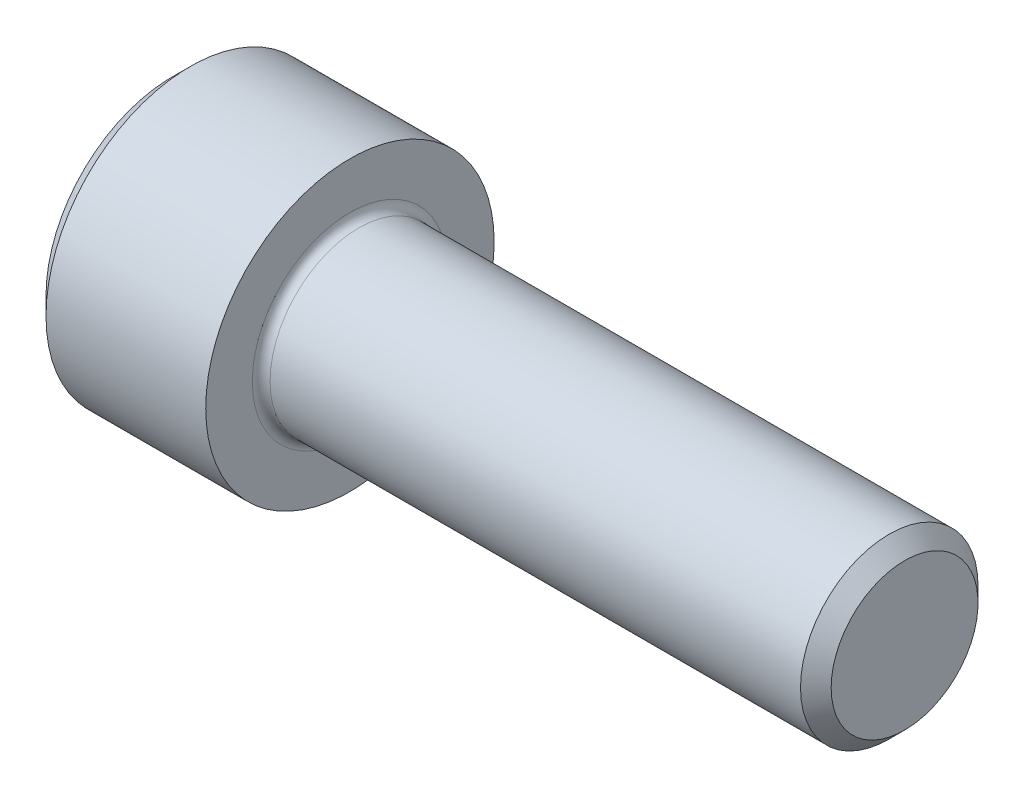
ISO-10303-21;
HEADER;
FILE_DESCRIPTION(('STEP AP214'),'2;1');
FILE_NAME('part.step','',(''),(''),'','','');
FILE_SCHEMA(('AUTOMOTIVE_DESIGN { 1 0 10303 214 1 1 1 1 }'));
ENDSEC;
DATA;
#1=APPLICATION_CONTEXT('core data for automotive mechanical design processes');
#2=APPLICATION_PROTOCOL_DEFINITION('international standard','automotive_design',2000,#1);
#3=PRODUCT_CONTEXT('',#1,'mechanical');
#4=PRODUCT('Part','Part','',(#3));
#5=PRODUCT_RELATED_PRODUCT_CATEGORY('part','',(#4));
#6=PRODUCT_DEFINITION_FORMATION('','',#4);
#7=PRODUCT_DEFINITION_CONTEXT('part definition',#1,'design');
#8=PRODUCT_DEFINITION('design','',#6,#7);
#9=PRODUCT_DEFINITION_SHAPE('','',#8);
#10=(LENGTH_UNIT() NAMED_UNIT(*) SI_UNIT(.MILLI.,.METRE.));
#11=(NAMED_UNIT(*) PLANE_ANGLE_UNIT() SI_UNIT($,.RADIAN.));
#12=(NAMED_UNIT(*) SI_UNIT($,.STERADIAN.) SOLID_ANGLE_UNIT());
#13=UNCERTAINTY_MEASURE_WITH_UNIT(LENGTH_MEASURE(1.E-05),#10,'distance_accuracy_value','');
#14=(GEOMETRIC_REPRESENTATION_CONTEXT(3) GLOBAL_UNCERTAINTY_ASSIGNED_CONTEXT((#13)) GLOBAL_UNIT_ASSIGNED_CONTEXT((#10,
#11,#12)) REPRESENTATION_CONTEXT('',''));
#15=CARTESIAN_POINT('',(0.,0.,0.));
#16=DIRECTION('',(0.,0.,1.));
#17=DIRECTION('',(1.,0.,0.));
#18=AXIS2_PLACEMENT_3D('',#15,#16,#17);
#19=CARTESIAN_POINT('',(33.,-3.349214,3.349214));
#20=DIRECTION('',(1.,0.,0.));
#21=DIRECTION('',(0.,0.,-1.));
#22=AXIS2_PLACEMENT_3D('',#19,#20,#21);
#23=PLANE('',#22);
#24=CARTESIAN_POINT('',(33.,0.,0.));
#25=DIRECTION('',(-1.,0.,0.));
#26=DIRECTION('',(0.,0.,1.));
#27=AXIS2_PLACEMENT_3D('',#24,#25,#26);
#28=CIRCLE('',#27,3.30949999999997);
#29=CARTESIAN_POINT('',(33.,0.,3.30949999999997));
#30=VERTEX_POINT('',#29);
#31=EDGE_CURVE('E20',#30,#30,#28,.F.);
#32=ORIENTED_EDGE('',*,*,#31,.T.);
#33=EDGE_LOOP('',(#32));
#34=FACE_BOUND('',#33,.T.);
#35=ADVANCED_FACE('F16',(#34),#23,.T.);
#36=CARTESIAN_POINT('',(33.,0.,0.));
#37=DIRECTION('',(-1.,0.,0.));
#38=DIRECTION('',(0.,0.,1.));
#39=AXIS2_PLACEMENT_3D('',#36,#37,#38);
#40=CONICAL_SURFACE('',#39,3.3095,0.785398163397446);
#41=CARTESIAN_POINT('',(32.3095,0.,0.));
#42=DIRECTION('',(-1.,0.,0.));
#43=DIRECTION('',(0.,0.,1.));
#44=AXIS2_PLACEMENT_3D('',#41,#42,#43);
#45=CIRCLE('',#44,4.);
#46=CARTESIAN_POINT('',(32.3095,0.,4.));
#47=VERTEX_POINT('',#46);
#48=EDGE_CURVE('E124',#47,#47,#45,.F.);
#49=ORIENTED_EDGE('',*,*,#48,.T.);
#50=EDGE_LOOP('',(#49));
#51=FACE_BOUND('',#50,.T.);
#52=ORIENTED_EDGE('',*,*,#31,.F.);
#53=EDGE_LOOP('',(#52));
#54=FACE_BOUND('',#53,.T.);
#55=ADVANCED_FACE('F254',(#51,#54),#40,.T.);
#56=CARTESIAN_POINT('',(32.3095,0.,0.));
#57=DIRECTION('',(-1.,0.,0.));
#58=DIRECTION('',(0.,0.,1.));
#59=AXIS2_PLACEMENT_3D('',#56,#57,#58);
#60=CYLINDRICAL_SURFACE('',#59,4.);
#61=CARTESIAN_POINT('',(8.40000000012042,0.,0.));
#62=DIRECTION('',(1.,0.,0.));
#63=DIRECTION('',(0.,0.,-1.));
#64=AXIS2_PLACEMENT_3D('',#61,#62,#63);
#65=CIRCLE('',#64,4.00000000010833);
#66=CARTESIAN_POINT('',(8.40000000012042,0.,-4.00000000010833));
#67=VERTEX_POINT('',#66);
#68=EDGE_CURVE('E120',#67,#67,#65,.T.);
#69=ORIENTED_EDGE('',*,*,#68,.T.);
#70=EDGE_LOOP('',(#69));
#71=FACE_BOUND('',#70,.T.);
#72=ORIENTED_EDGE('',*,*,#48,.F.);
#73=EDGE_LOOP('',(#72));
#74=FACE_BOUND('',#73,.T.);
#75=ADVANCED_FACE('F250',(#71,#74),#60,.T.);
#76=CARTESIAN_POINT('',(8.40000000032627,0.,0.));
#77=DIRECTION('',(1.,0.,0.));
#78=DIRECTION('',(0.,0.,-1.));
#79=AXIS2_PLACEMENT_3D('',#76,#77,#78);
#80=TOROIDAL_SURFACE('',#79,4.40000000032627,0.400000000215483);
#81=ORIENTED_EDGE('',*,*,#68,.F.);
#82=EDGE_LOOP('',(#81));
#83=FACE_BOUND('',#82,.T.);
#84=CARTESIAN_POINT('',(8.00000000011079,0.,0.));
#85=DIRECTION('',(1.,0.,0.));
#86=DIRECTION('',(0.,0.,-1.));
#87=AXIS2_PLACEMENT_3D('',#84,#85,#86);
#88=CIRCLE('',#87,4.400000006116);
#89=CARTESIAN_POINT('',(8.00000000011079,0.,-4.400000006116));
#90=VERTEX_POINT('',#89);
#91=EDGE_CURVE('E118',#90,#90,#88,.F.);
#92=ORIENTED_EDGE('',*,*,#91,.F.);
#93=EDGE_LOOP('',(#92));
#94=FACE_BOUND('',#93,.T.);
#95=ADVANCED_FACE('F253',(#83,#94),#80,.F.);
#96=CARTESIAN_POINT('',(8.,-6.578,6.578));
#97=DIRECTION('',(1.,0.,0.));
#98=DIRECTION('',(0.,0.,-1.));
#99=AXIS2_PLACEMENT_3D('',#96,#97,#98);
#100=PLANE('',#99);
#101=ORIENTED_EDGE('',*,*,#91,.T.);
#102=EDGE_LOOP('',(#101));
#103=FACE_BOUND('',#102,.T.);
#104=CARTESIAN_POINT('',(8.,0.,0.));
#105=DIRECTION('',(-1.,0.,0.));
#106=DIRECTION('',(0.,0.,1.));
#107=AXIS2_PLACEMENT_3D('',#104,#105,#106);
#108=CIRCLE('',#107,6.5);
#109=CARTESIAN_POINT('',(8.,0.,6.5));
#110=VERTEX_POINT('',#109);
#111=EDGE_CURVE('E116',#110,#110,#108,.F.);
#112=ORIENTED_EDGE('',*,*,#111,.T.);
#113=EDGE_LOOP('',(#112));
#114=FACE_BOUND('',#113,.T.);
#115=ADVANCED_FACE('F248',(#103,#114),#100,.T.);
#116=CARTESIAN_POINT('',(8.,0.,0.));
#117=DIRECTION('',(-1.,0.,0.));
#118=DIRECTION('',(0.,0.,1.));
#119=AXIS2_PLACEMENT_3D('',#116,#117,#118);
#120=CYLINDRICAL_SURFACE('',#119,6.5);
#121=CARTESIAN_POINT('',(0.799999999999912,0.,0.));
#122=DIRECTION('',(1.,0.,0.));
#123=DIRECTION('',(0.,0.,-1.));
#124=AXIS2_PLACEMENT_3D('',#121,#122,#123);
#125=CIRCLE('',#124,6.5);
#126=CARTESIAN_POINT('',(0.8,0.,-6.5));
#127=VERTEX_POINT('',#126);
#128=EDGE_CURVE('E93',#127,#127,#125,.T.);
#129=ORIENTED_EDGE('',*,*,#128,.T.);
#130=EDGE_LOOP('',(#129));
#131=FACE_BOUND('',#130,.T.);
#132=ORIENTED_EDGE('',*,*,#111,.F.);
#133=EDGE_LOOP('',(#132));
#134=FACE_BOUND('',#133,.T.);
#135=ADVANCED_FACE('F244',(#131,#134),#120,.T.);
#136=CARTESIAN_POINT('',(0.,0.,0.));
#137=DIRECTION('',(1.,0.,0.));
#138=DIRECTION('',(0.,0.,-1.));
#139=AXIS2_PLACEMENT_3D('',#136,#137,#138);
#140=CONICAL_SURFACE('',#139,5.7,0.785398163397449);
#141=ORIENTED_EDGE('',*,*,#128,.F.);
#142=EDGE_LOOP('',(#141));
#143=FACE_BOUND('',#142,.T.);
#144=CARTESIAN_POINT('',(0.,0.,0.));
#145=DIRECTION('',(1.,0.,0.));
#146=DIRECTION('',(0.,0.,-1.));
#147=AXIS2_PLACEMENT_3D('',#144,#145,#146);
#148=CIRCLE('',#147,5.7);
#149=CARTESIAN_POINT('',(0.,0.,-5.7));
#150=VERTEX_POINT('',#149);
#151=EDGE_CURVE('E92',#150,#150,#148,.F.);
#152=ORIENTED_EDGE('',*,*,#151,.F.);
#153=EDGE_LOOP('',(#152));
#154=FACE_BOUND('',#153,.T.);
#155=ADVANCED_FACE('F241',(#143,#154),#140,.T.);
#156=CARTESIAN_POINT('',(0.,1.759474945,-3.0475));
#157=DIRECTION('',(0.,0.866025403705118,-0.500000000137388));
#158=DIRECTION('',(0.,0.500000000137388,0.866025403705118));
#159=AXIS2_PLACEMENT_3D('',#156,#157,#158);
#160=PLANE('',#159);
#161=DIRECTION('',(1.,0.,0.));
#162=VECTOR('',#161,1.);
#163=CARTESIAN_POINT('',(2.,1.759474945,-3.0475));
#164=LINE('',#163,#162);
#165=CARTESIAN_POINT('',(0.,1.75947494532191,-3.0475));
#166=VERTEX_POINT('',#165);
#167=CARTESIAN_POINT('',(4.,1.759474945,-3.0475));
#168=VERTEX_POINT('',#167);
#169=EDGE_CURVE('E159',#166,#168,#164,.T.);
#170=ORIENTED_EDGE('',*,*,#169,.T.);
#171=DIRECTION('',(0.,0.500000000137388,0.866025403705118));
#172=VECTOR('',#171,1.);
#173=CARTESIAN_POINT('',(4.,1.759474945,-3.0475));
#174=LINE('',#173,#172);
#175=CARTESIAN_POINT('',(4.,2.63921241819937,-1.52374999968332));
#176=VERTEX_POINT('',#175);
#177=EDGE_CURVE('E157',#168,#176,#174,.T.);
#178=ORIENTED_EDGE('',*,*,#177,.T.);
#179=DIRECTION('',(0.,0.500000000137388,0.866025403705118));
#180=VECTOR('',#179,1.);
#181=CARTESIAN_POINT('',(4.,1.759474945,-3.0475));
#182=LINE('',#181,#180);
#183=CARTESIAN_POINT('',(4.,3.518949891,0.));
#184=VERTEX_POINT('',#183);
#185=EDGE_CURVE('E87',#176,#184,#182,.T.);
#186=ORIENTED_EDGE('',*,*,#185,.T.);
#187=DIRECTION('',(1.,0.,0.));
#188=VECTOR('',#187,1.);
#189=CARTESIAN_POINT('',(2.,3.518949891,0.));
#190=LINE('',#189,#188);
#191=CARTESIAN_POINT('',(0.,3.5189498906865,-4.93629063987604E-11));
#192=VERTEX_POINT('',#191);
#193=EDGE_CURVE('E80',#192,#184,#190,.T.);
#194=ORIENTED_EDGE('',*,*,#193,.F.);
#195=DIRECTION('',(0.,0.499999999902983,0.866025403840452));
#196=VECTOR('',#195,1.);
#197=CARTESIAN_POINT('',(0.,1.759474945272,-3.047500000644));
#198=LINE('',#197,#196);
#199=EDGE_CURVE('E84',#166,#192,#198,.T.);
#200=ORIENTED_EDGE('',*,*,#199,.F.);
#201=EDGE_LOOP('',(#170,#178,#186,#194,#200));
#202=FACE_BOUND('',#201,.T.);
#203=ADVANCED_FACE('F83',(#202),#160,.F.);
#204=CARTESIAN_POINT('',(0.,1.759474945,3.0475));
#205=DIRECTION('',(0.,-0.866025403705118,-0.500000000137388));
#206=DIRECTION('',(0.,0.500000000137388,-0.866025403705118));
#207=AXIS2_PLACEMENT_3D('',#204,#205,#206);
#208=PLANE('',#207);
#209=DIRECTION('',(0.,0.500000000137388,-0.866025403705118));
#210=VECTOR('',#209,1.);
#211=CARTESIAN_POINT('',(4.,1.759474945,3.0475));
#212=LINE('',#211,#210);
#213=CARTESIAN_POINT('',(4.,2.63921241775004,1.52375000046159));
#214=VERTEX_POINT('',#213);
#215=CARTESIAN_POINT('',(4.,1.759474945,3.0475));
#216=VERTEX_POINT('',#215);
#217=EDGE_CURVE('E105',#214,#216,#212,.F.);
#218=ORIENTED_EDGE('',*,*,#217,.T.);
#219=DIRECTION('',(-1.,0.,0.));
#220=VECTOR('',#219,1.);
#221=CARTESIAN_POINT('',(2.,1.759474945,3.0475));
#222=LINE('',#221,#220);
#223=CARTESIAN_POINT('',(0.,1.75947494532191,3.0475));
#224=VERTEX_POINT('',#223);
#225=EDGE_CURVE('E110',#216,#224,#222,.T.);
#226=ORIENTED_EDGE('',*,*,#225,.T.);
#227=DIRECTION('',(0.,-0.499999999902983,0.866025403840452));
#228=VECTOR('',#227,1.);
#229=CARTESIAN_POINT('',(0.,3.518949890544,0.));
#230=LINE('',#229,#228);
#231=EDGE_CURVE('E100',#192,#224,#230,.T.);
#232=ORIENTED_EDGE('',*,*,#231,.F.);
#233=ORIENTED_EDGE('',*,*,#193,.T.);
#234=DIRECTION('',(0.,0.500000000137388,-0.866025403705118));
#235=VECTOR('',#234,1.);
#236=CARTESIAN_POINT('',(4.,1.759474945,3.0475));
#237=LINE('',#236,#235);
#238=EDGE_CURVE('E160',#184,#214,#237,.F.);
#239=ORIENTED_EDGE('',*,*,#238,.T.);
#240=EDGE_LOOP('',(#218,#226,#232,#233,#239));
#241=FACE_BOUND('',#240,.T.);
#242=ADVANCED_FACE('F108',(#241),#208,.T.);
#243=CARTESIAN_POINT('',(0.,-5.7684,-5.7684));
#244=DIRECTION('',(-1.,0.,0.));
#245=DIRECTION('',(0.,0.,1.));
#246=AXIS2_PLACEMENT_3D('',#243,#244,#245);
#247=PLANE('',#246);
#248=DIRECTION('',(0.,1.,0.));
#249=VECTOR('',#248,1.);
#250=CARTESIAN_POINT('',(0.,0.,-3.0475));
#251=LINE('',#250,#249);
#252=CARTESIAN_POINT('',(0.,-1.759474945,-3.0475));
#253=VERTEX_POINT('',#252);
#254=EDGE_CURVE('E104',#253,#166,#251,.T.);
#255=ORIENTED_EDGE('',*,*,#254,.T.);
#256=ORIENTED_EDGE('',*,*,#199,.T.);
#257=ORIENTED_EDGE('',*,*,#231,.T.);
#258=DIRECTION('',(0.,-1.,0.));
#259=VECTOR('',#258,1.);
#260=CARTESIAN_POINT('',(0.,0.,3.0475));
#261=LINE('',#260,#259);
#262=CARTESIAN_POINT('',(0.,-1.759474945,3.0475));
#263=VERTEX_POINT('',#262);
#264=EDGE_CURVE('E172',#224,#263,#261,.T.);
#265=ORIENTED_EDGE('',*,*,#264,.T.);
#266=DIRECTION('',(0.,0.500000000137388,0.866025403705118));
#267=VECTOR('',#266,1.);
#268=CARTESIAN_POINT('',(0.,-2.639212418,1.52375));
#269=LINE('',#268,#267);
#270=CARTESIAN_POINT('',(0.,-3.518949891,0.));
#271=VERTEX_POINT('',#270);
#272=EDGE_CURVE('E198',#271,#263,#269,.T.);
#273=ORIENTED_EDGE('',*,*,#272,.F.);
#274=DIRECTION('',(0.,-0.500000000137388,0.866025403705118));
#275=VECTOR('',#274,1.);
#276=CARTESIAN_POINT('',(0.,-2.639212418,-1.52375));
#277=LINE('',#276,#275);
#278=EDGE_CURVE('E178',#253,#271,#277,.T.);
#279=ORIENTED_EDGE('',*,*,#278,.F.);
#280=EDGE_LOOP('',(#255,#256,#257,#265,#273,#279));
#281=FACE_BOUND('',#280,.T.);
#282=ORIENTED_EDGE('',*,*,#151,.T.);
#283=EDGE_LOOP('',(#282));
#284=FACE_BOUND('',#283,.T.);
#285=ADVANCED_FACE('F97',(#281,#284),#247,.T.);
#286=CARTESIAN_POINT('',(4.,-0.015835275,3.0475));
#287=DIRECTION('',(1.,0.,0.));
#288=DIRECTION('',(0.,0.,-1.));
#289=AXIS2_PLACEMENT_3D('',#286,#287,#288);
#290=PLANE('',#289);
#291=ORIENTED_EDGE('',*,*,#217,.F.);
#292=CARTESIAN_POINT('',(4.,0.,0.));
#293=DIRECTION('',(-1.,0.,0.));
#294=DIRECTION('',(0.,0.,1.));
#295=AXIS2_PLACEMENT_3D('',#292,#293,#294);
#296=CIRCLE('',#295,3.0475);
#297=CARTESIAN_POINT('',(4.,-2.73646157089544E-10,3.0475));
#298=VERTEX_POINT('',#297);
#299=EDGE_CURVE('E153',#298,#214,#296,.T.);
#300=ORIENTED_EDGE('',*,*,#299,.F.);
#301=DIRECTION('',(0.,1.,0.));
#302=VECTOR('',#301,1.);
#303=CARTESIAN_POINT('',(4.,0.,3.0475));
#304=LINE('',#303,#302);
#305=EDGE_CURVE('E169',#298,#216,#304,.T.);
#306=ORIENTED_EDGE('',*,*,#305,.T.);
#307=EDGE_LOOP('',(#291,#300,#306));
#308=FACE_BOUND('',#307,.T.);
#309=ADVANCED_FACE('F174',(#308),#290,.F.);
#310=CARTESIAN_POINT('',(4.,2.633933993,1.542035));
#311=DIRECTION('',(1.,0.,0.));
#312=DIRECTION('',(0.,0.,-1.));
#313=AXIS2_PLACEMENT_3D('',#310,#311,#312);
#314=PLANE('',#313);
#315=ORIENTED_EDGE('',*,*,#185,.F.);
#316=CARTESIAN_POINT('',(4.,0.,0.));
#317=DIRECTION('',(-1.,0.,0.));
#318=DIRECTION('',(0.,0.,1.));
#319=AXIS2_PLACEMENT_3D('',#316,#317,#318);
#320=CIRCLE('',#319,3.0475);
#321=EDGE_CURVE('E150',#214,#176,#320,.T.);
#322=ORIENTED_EDGE('',*,*,#321,.F.);
#323=ORIENTED_EDGE('',*,*,#238,.F.);
#324=EDGE_LOOP('',(#315,#322,#323));
#325=FACE_BOUND('',#324,.T.);
#326=ADVANCED_FACE('F221',(#325),#314,.F.);
#327=CARTESIAN_POINT('',(4.,-0.015835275,-1.5146075));
#328=DIRECTION('',(1.,0.,0.));
#329=DIRECTION('',(0.,0.,-1.));
#330=AXIS2_PLACEMENT_3D('',#327,#328,#329);
#331=PLANE('',#330);
#332=DIRECTION('',(0.,-1.,0.));
#333=VECTOR('',#332,1.);
#334=CARTESIAN_POINT('',(4.,0.,-3.0475));
#335=LINE('',#334,#333);
#336=CARTESIAN_POINT('',(4.,-6.2505282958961E-10,-3.0475));
#337=VERTEX_POINT('',#336);
#338=EDGE_CURVE('E189',#168,#337,#335,.T.);
#339=ORIENTED_EDGE('',*,*,#338,.T.);
#340=CARTESIAN_POINT('',(4.,0.,0.));
#341=DIRECTION('',(-1.,0.,0.));
#342=DIRECTION('',(0.,0.,1.));
#343=AXIS2_PLACEMENT_3D('',#340,#341,#342);
#344=CIRCLE('',#343,3.0475);
#345=EDGE_CURVE('E148',#176,#337,#344,.T.);
#346=ORIENTED_EDGE('',*,*,#345,.F.);
#347=ORIENTED_EDGE('',*,*,#177,.F.);
#348=EDGE_LOOP('',(#339,#346,#347));
#349=FACE_BOUND('',#348,.T.);
#350=ADVANCED_FACE('F217',(#349),#331,.F.);
#351=CARTESIAN_POINT('',(0.,-1.759474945,-3.0475));
#352=DIRECTION('',(0.,0.,-1.));
#353=DIRECTION('',(0.,1.,0.));
#354=AXIS2_PLACEMENT_3D('',#351,#352,#353);
#355=PLANE('',#354);
#356=DIRECTION('',(-1.,0.,0.));
#357=VECTOR('',#356,1.);
#358=CARTESIAN_POINT('',(2.,-1.759474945,-3.0475));
#359=LINE('',#358,#357);
#360=CARTESIAN_POINT('',(4.,-1.759474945,-3.0475));
#361=VERTEX_POINT('',#360);
#362=EDGE_CURVE('E175',#361,#253,#359,.T.);
#363=ORIENTED_EDGE('',*,*,#362,.F.);
#364=DIRECTION('',(0.,1.,0.));
#365=VECTOR('',#364,1.);
#366=CARTESIAN_POINT('',(4.,-1.319606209,-3.0475));
#367=LINE('',#366,#365);
#368=EDGE_CURVE('E144',#361,#337,#367,.T.);
#369=ORIENTED_EDGE('',*,*,#368,.T.);
#370=ORIENTED_EDGE('',*,*,#338,.F.);
#371=ORIENTED_EDGE('',*,*,#169,.F.);
#372=ORIENTED_EDGE('',*,*,#254,.F.);
#373=EDGE_LOOP('',(#363,#369,#370,#371,#372));
#374=FACE_BOUND('',#373,.T.);
#375=ADVANCED_FACE('F212',(#374),#355,.F.);
#376=CARTESIAN_POINT('',(0.,-1.759474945,-3.0475));
#377=DIRECTION('',(0.,0.866025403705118,0.500000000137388));
#378=DIRECTION('',(0.,-0.500000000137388,0.866025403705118));
#379=AXIS2_PLACEMENT_3D('',#376,#377,#378);
#380=PLANE('',#379);
#381=DIRECTION('',(0.,-0.500000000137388,0.866025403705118));
#382=VECTOR('',#381,1.);
#383=CARTESIAN_POINT('',(4.,-1.759474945,-3.0475));
#384=LINE('',#383,#382);
#385=CARTESIAN_POINT('',(4.,-2.63921241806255,-1.5237499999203));
#386=VERTEX_POINT('',#385);
#387=EDGE_CURVE('E145',#386,#361,#384,.F.);
#388=ORIENTED_EDGE('',*,*,#387,.T.);
#389=ORIENTED_EDGE('',*,*,#362,.T.);
#390=ORIENTED_EDGE('',*,*,#278,.T.);
#391=DIRECTION('',(-1.,0.,0.));
#392=VECTOR('',#391,1.);
#393=CARTESIAN_POINT('',(2.,-3.518949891,0.));
#394=LINE('',#393,#392);
#395=CARTESIAN_POINT('',(4.,-3.518949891,0.));
#396=VERTEX_POINT('',#395);
#397=EDGE_CURVE('E156',#396,#271,#394,.T.);
#398=ORIENTED_EDGE('',*,*,#397,.F.);
#399=DIRECTION('',(0.,-0.500000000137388,0.866025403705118));
#400=VECTOR('',#399,1.);
#401=CARTESIAN_POINT('',(4.,-1.759474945,-3.0475));
#402=LINE('',#401,#400);
#403=EDGE_CURVE('E140',#396,#386,#402,.F.);
#404=ORIENTED_EDGE('',*,*,#403,.T.);
#405=EDGE_LOOP('',(#388,#389,#390,#398,#404));
#406=FACE_BOUND('',#405,.T.);
#407=ADVANCED_FACE('F297',(#406),#380,.T.);
#408=CARTESIAN_POINT('',(0.,1.759474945,3.0475));
#409=DIRECTION('',(0.,0.,1.));
#410=DIRECTION('',(0.,-1.,0.));
#411=AXIS2_PLACEMENT_3D('',#408,#409,#410);
#412=PLANE('',#411);
#413=ORIENTED_EDGE('',*,*,#225,.F.);
#414=ORIENTED_EDGE('',*,*,#305,.F.);
#415=DIRECTION('',(0.,-1.,0.));
#416=VECTOR('',#415,1.);
#417=CARTESIAN_POINT('',(4.,-1.319606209,3.0475));
#418=LINE('',#417,#416);
#419=CARTESIAN_POINT('',(4.,-1.759474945,3.0475));
#420=VERTEX_POINT('',#419);
#421=EDGE_CURVE('E139',#298,#420,#418,.T.);
#422=ORIENTED_EDGE('',*,*,#421,.T.);
#423=DIRECTION('',(1.,0.,0.));
#424=VECTOR('',#423,1.);
#425=CARTESIAN_POINT('',(2.,-1.759474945,3.0475));
#426=LINE('',#425,#424);
#427=EDGE_CURVE('E186',#263,#420,#426,.T.);
#428=ORIENTED_EDGE('',*,*,#427,.F.);
#429=ORIENTED_EDGE('',*,*,#264,.F.);
#430=EDGE_LOOP('',(#413,#414,#422,#428,#429));
#431=FACE_BOUND('',#430,.T.);
#432=ADVANCED_FACE('F167',(#431),#412,.F.);
#433=CARTESIAN_POINT('',(0.,-3.518949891,0.));
#434=DIRECTION('',(0.,0.866025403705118,-0.500000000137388));
#435=DIRECTION('',(0.,0.500000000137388,0.866025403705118));
#436=AXIS2_PLACEMENT_3D('',#433,#434,#435);
#437=PLANE('',#436);
#438=DIRECTION('',(0.,0.500000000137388,0.866025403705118));
#439=VECTOR('',#438,1.);
#440=CARTESIAN_POINT('',(4.,-3.518949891,0.));
#441=LINE('',#440,#439);
#442=CARTESIAN_POINT('',(4.,-2.63921241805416,1.52374999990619));
#443=VERTEX_POINT('',#442);
#444=EDGE_CURVE('E35',#443,#396,#441,.F.);
#445=ORIENTED_EDGE('',*,*,#444,.T.);
#446=ORIENTED_EDGE('',*,*,#397,.T.);
#447=ORIENTED_EDGE('',*,*,#272,.T.);
#448=ORIENTED_EDGE('',*,*,#427,.T.);
#449=DIRECTION('',(0.,0.500000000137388,0.866025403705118));
#450=VECTOR('',#449,1.);
#451=CARTESIAN_POINT('',(4.,-3.518949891,0.));
#452=LINE('',#451,#450);
#453=EDGE_CURVE('E136',#420,#443,#452,.F.);
#454=ORIENTED_EDGE('',*,*,#453,.T.);
#455=EDGE_LOOP('',(#445,#446,#447,#448,#454));
#456=FACE_BOUND('',#455,.T.);
#457=ADVANCED_FACE('F311',(#456),#437,.T.);
#458=CARTESIAN_POINT('',(4.,-2.655047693,-1.5146075));
#459=DIRECTION('',(1.,0.,0.));
#460=DIRECTION('',(0.,0.,-1.));
#461=AXIS2_PLACEMENT_3D('',#458,#459,#460);
#462=PLANE('',#461);
#463=ORIENTED_EDGE('',*,*,#387,.F.);
#464=CARTESIAN_POINT('',(4.,0.,0.));
#465=DIRECTION('',(-1.,0.,0.));
#466=DIRECTION('',(0.,0.,1.));
#467=AXIS2_PLACEMENT_3D('',#464,#465,#466);
#468=CIRCLE('',#467,3.0475);
#469=EDGE_CURVE('E133',#337,#386,#468,.T.);
#470=ORIENTED_EDGE('',*,*,#469,.F.);
#471=ORIENTED_EDGE('',*,*,#368,.F.);
#472=EDGE_LOOP('',(#463,#470,#471));
#473=FACE_BOUND('',#472,.T.);
#474=ADVANCED_FACE('F318',(#473),#462,.F.);
#475=CARTESIAN_POINT('',(4.,-3.524228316,1.542035));
#476=DIRECTION('',(1.,0.,0.));
#477=DIRECTION('',(0.,0.,-1.));
#478=AXIS2_PLACEMENT_3D('',#475,#476,#477);
#479=PLANE('',#478);
#480=ORIENTED_EDGE('',*,*,#444,.F.);
#481=CARTESIAN_POINT('',(4.,0.,0.));
#482=DIRECTION('',(-1.,0.,0.));
#483=DIRECTION('',(0.,0.,1.));
#484=AXIS2_PLACEMENT_3D('',#481,#482,#483);
#485=CIRCLE('',#484,3.0475);
#486=EDGE_CURVE('E26',#386,#443,#485,.T.);
#487=ORIENTED_EDGE('',*,*,#486,.F.);
#488=ORIENTED_EDGE('',*,*,#403,.F.);
#489=EDGE_LOOP('',(#480,#487,#488));
#490=FACE_BOUND('',#489,.T.);
#491=ADVANCED_FACE('F237',(#490),#479,.F.);
#492=CARTESIAN_POINT('',(4.,-2.655047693,3.0475));
#493=DIRECTION('',(1.,0.,0.));
#494=DIRECTION('',(0.,0.,-1.));
#495=AXIS2_PLACEMENT_3D('',#492,#493,#494);
#496=PLANE('',#495);
#497=ORIENTED_EDGE('',*,*,#421,.F.);
#498=CARTESIAN_POINT('',(4.,0.,0.));
#499=DIRECTION('',(-1.,0.,0.));
#500=DIRECTION('',(0.,0.,1.));
#501=AXIS2_PLACEMENT_3D('',#498,#499,#500);
#502=CIRCLE('',#501,3.0475);
#503=EDGE_CURVE('E10',#443,#298,#502,.T.);
#504=ORIENTED_EDGE('',*,*,#503,.F.);
#505=ORIENTED_EDGE('',*,*,#453,.F.);
#506=EDGE_LOOP('',(#497,#504,#505));
#507=FACE_BOUND('',#506,.T.);
#508=ADVANCED_FACE('F18',(#507),#496,.F.);
#509=CARTESIAN_POINT('',(5.759474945,0.,0.));
#510=DIRECTION('',(-1.,0.,0.));
#511=DIRECTION('',(0.,0.,1.));
#512=AXIS2_PLACEMENT_3D('',#509,#510,#511);
#513=CONICAL_SURFACE('',#512,0.,1.04719755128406);
#514=CARTESIAN_POINT('',(5.759474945,0.,0.));
#515=VERTEX_POINT('',#514);
#516=VERTEX_LOOP('',#515);
#517=FACE_BOUND('',#516,.T.);
#518=ORIENTED_EDGE('',*,*,#486,.T.);
#519=ORIENTED_EDGE('',*,*,#503,.T.);
#520=ORIENTED_EDGE('',*,*,#299,.T.);
#521=ORIENTED_EDGE('',*,*,#321,.T.);
#522=ORIENTED_EDGE('',*,*,#345,.T.);
#523=ORIENTED_EDGE('',*,*,#469,.T.);
#524=EDGE_LOOP('',(#518,#519,#520,#521,#522,#523));
#525=FACE_BOUND('',#524,.T.);
#526=ADVANCED_FACE('F219',(#517,#525),#513,.F.);
#527=CLOSED_SHELL('',(#35,#55,#75,#95,#115,#135,#155,#203,#242,#285,#309,#326,#350,#375,#407,
#432,#457,#474,#491,#508,#526));
#528=MANIFOLD_SOLID_BREP('B1',#527);
#529=ADVANCED_BREP_SHAPE_REPRESENTATION('',(#18,#528),#14);
#530=SHAPE_DEFINITION_REPRESENTATION(#9,#529);
ENDSEC;
END-ISO-10303-21;
